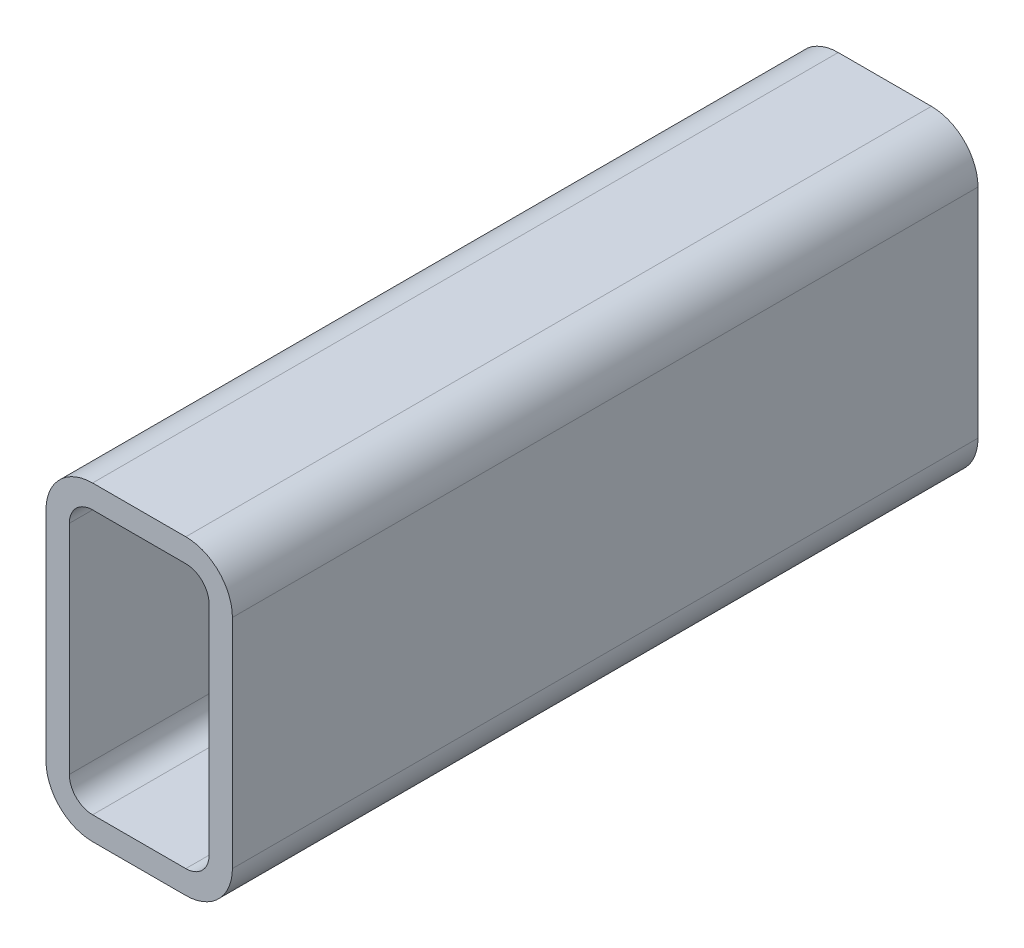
ISO-10303-21;
HEADER;
FILE_DESCRIPTION(('STEP AP214'),'2;1');
FILE_NAME('part.step','',(''),(''),'','','');
FILE_SCHEMA(('AUTOMOTIVE_DESIGN { 1 0 10303 214 1 1 1 1 }'));
ENDSEC;
DATA;
#1=APPLICATION_CONTEXT('core data for automotive mechanical design processes');
#2=APPLICATION_PROTOCOL_DEFINITION('international standard','automotive_design',2000,#1);
#3=PRODUCT_CONTEXT('',#1,'mechanical');
#4=PRODUCT('Part','Part','',(#3));
#5=PRODUCT_RELATED_PRODUCT_CATEGORY('part','',(#4));
#6=PRODUCT_DEFINITION_FORMATION('','',#4);
#7=PRODUCT_DEFINITION_CONTEXT('part definition',#1,'design');
#8=PRODUCT_DEFINITION('design','',#6,#7);
#9=PRODUCT_DEFINITION_SHAPE('','',#8);
#10=(LENGTH_UNIT() NAMED_UNIT(*) SI_UNIT(.MILLI.,.METRE.));
#11=(NAMED_UNIT(*) PLANE_ANGLE_UNIT() SI_UNIT($,.RADIAN.));
#12=(NAMED_UNIT(*) SI_UNIT($,.STERADIAN.) SOLID_ANGLE_UNIT());
#13=UNCERTAINTY_MEASURE_WITH_UNIT(LENGTH_MEASURE(1.E-05),#10,'distance_accuracy_value','');
#14=(GEOMETRIC_REPRESENTATION_CONTEXT(3) GLOBAL_UNCERTAINTY_ASSIGNED_CONTEXT((#13)) GLOBAL_UNIT_ASSIGNED_CONTEXT((#10,
#11,#12)) REPRESENTATION_CONTEXT('',''));
#15=CARTESIAN_POINT('',(0.,0.,0.));
#16=DIRECTION('',(0.,0.,1.));
#17=DIRECTION('',(1.,0.,0.));
#18=AXIS2_PLACEMENT_3D('',#15,#16,#17);
#19=CARTESIAN_POINT('',(21.5391160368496,109.98485662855,304.8));
#20=DIRECTION('',(0.,0.,1.));
#21=DIRECTION('',(1.,0.,0.));
#22=AXIS2_PLACEMENT_3D('',#19,#20,#21);
#23=PLANE('',#22);
#24=CARTESIAN_POINT('',(21.5391160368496,109.98485662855,304.8));
#25=DIRECTION('',(0.,0.,1.));
#26=DIRECTION('',(1.,0.,0.));
#27=AXIS2_PLACEMENT_3D('',#24,#25,#26);
#28=CIRCLE('',#27,19.05);
#29=CARTESIAN_POINT('',(21.5391160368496,129.03485662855,304.8));
#30=VERTEX_POINT('',#29);
#31=CARTESIAN_POINT('',(2.48911603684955,109.98485662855,304.8));
#32=VERTEX_POINT('',#31);
#33=EDGE_CURVE('E211',#30,#32,#28,.T.);
#34=ORIENTED_EDGE('',*,*,#33,.T.);
#35=DIRECTION('',(0.,-1.,0.));
#36=VECTOR('',#35,1.);
#37=CARTESIAN_POINT('',(2.48911603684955,21.08485662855,304.8));
#38=LINE('',#37,#36);
#39=CARTESIAN_POINT('',(2.48911603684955,21.08485662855,304.8));
#40=VERTEX_POINT('',#39);
#41=EDGE_CURVE('E214',#32,#40,#38,.T.);
#42=ORIENTED_EDGE('',*,*,#41,.T.);
#43=CARTESIAN_POINT('',(21.5391160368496,21.08485662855,304.8));
#44=DIRECTION('',(0.,0.,1.));
#45=DIRECTION('',(1.,0.,0.));
#46=AXIS2_PLACEMENT_3D('',#43,#44,#45);
#47=CIRCLE('',#46,19.05);
#48=CARTESIAN_POINT('',(21.5391160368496,2.03485662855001,304.8));
#49=VERTEX_POINT('',#48);
#50=EDGE_CURVE('E217',#40,#49,#47,.T.);
#51=ORIENTED_EDGE('',*,*,#50,.T.);
#52=DIRECTION('',(1.,0.,0.));
#53=VECTOR('',#52,1.);
#54=CARTESIAN_POINT('',(59.6391160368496,2.03485662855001,304.8));
#55=LINE('',#54,#53);
#56=CARTESIAN_POINT('',(59.6391160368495,2.03485662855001,304.8));
#57=VERTEX_POINT('',#56);
#58=EDGE_CURVE('E219',#49,#57,#55,.T.);
#59=ORIENTED_EDGE('',*,*,#58,.T.);
#60=CARTESIAN_POINT('',(59.6391160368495,21.08485662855,304.8));
#61=DIRECTION('',(0.,0.,1.));
#62=DIRECTION('',(1.,0.,0.));
#63=AXIS2_PLACEMENT_3D('',#60,#61,#62);
#64=CIRCLE('',#63,19.05);
#65=CARTESIAN_POINT('',(78.6891160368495,21.08485662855,304.8));
#66=VERTEX_POINT('',#65);
#67=EDGE_CURVE('E221',#57,#66,#64,.T.);
#68=ORIENTED_EDGE('',*,*,#67,.T.);
#69=DIRECTION('',(0.,1.,0.));
#70=VECTOR('',#69,1.);
#71=CARTESIAN_POINT('',(78.6891160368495,109.98485662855,304.8));
#72=LINE('',#71,#70);
#73=CARTESIAN_POINT('',(78.6891160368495,109.98485662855,304.8));
#74=VERTEX_POINT('',#73);
#75=EDGE_CURVE('E223',#66,#74,#72,.T.);
#76=ORIENTED_EDGE('',*,*,#75,.T.);
#77=CARTESIAN_POINT('',(59.6391160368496,109.98485662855,304.8));
#78=DIRECTION('',(0.,0.,1.));
#79=DIRECTION('',(1.,0.,0.));
#80=AXIS2_PLACEMENT_3D('',#77,#78,#79);
#81=CIRCLE('',#80,19.05);
#82=CARTESIAN_POINT('',(59.6391160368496,129.03485662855,304.8));
#83=VERTEX_POINT('',#82);
#84=EDGE_CURVE('E225',#74,#83,#81,.T.);
#85=ORIENTED_EDGE('',*,*,#84,.T.);
#86=DIRECTION('',(-1.,0.,0.));
#87=VECTOR('',#86,1.);
#88=CARTESIAN_POINT('',(21.5391160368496,129.03485662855,304.8));
#89=LINE('',#88,#87);
#90=EDGE_CURVE('E227',#83,#30,#89,.T.);
#91=ORIENTED_EDGE('',*,*,#90,.T.);
#92=EDGE_LOOP('',(#34,#42,#51,#59,#68,#76,#85,#91));
#93=FACE_BOUND('',#92,.T.);
#94=DIRECTION('',(0.,-1.,0.));
#95=VECTOR('',#94,1.);
#96=CARTESIAN_POINT('',(12.0141160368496,21.08485662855,304.8));
#97=LINE('',#96,#95);
#98=CARTESIAN_POINT('',(12.0141160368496,109.98485662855,304.8));
#99=VERTEX_POINT('',#98);
#100=CARTESIAN_POINT('',(12.0141160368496,21.08485662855,304.8));
#101=VERTEX_POINT('',#100);
#102=EDGE_CURVE('E154',#99,#101,#97,.T.);
#103=ORIENTED_EDGE('',*,*,#102,.F.);
#104=CARTESIAN_POINT('',(21.5391160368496,109.98485662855,304.8));
#105=DIRECTION('',(0.,0.,1.));
#106=DIRECTION('',(1.,0.,0.));
#107=AXIS2_PLACEMENT_3D('',#104,#105,#106);
#108=CIRCLE('',#107,9.525);
#109=CARTESIAN_POINT('',(21.5391160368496,119.50985662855,304.8));
#110=VERTEX_POINT('',#109);
#111=EDGE_CURVE('E146',#110,#99,#108,.T.);
#112=ORIENTED_EDGE('',*,*,#111,.F.);
#113=DIRECTION('',(-1.,0.,0.));
#114=VECTOR('',#113,1.);
#115=CARTESIAN_POINT('',(21.5391160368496,119.50985662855,304.8));
#116=LINE('',#115,#114);
#117=CARTESIAN_POINT('',(59.6391160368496,119.50985662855,304.8));
#118=VERTEX_POINT('',#117);
#119=EDGE_CURVE('E179',#118,#110,#116,.T.);
#120=ORIENTED_EDGE('',*,*,#119,.F.);
#121=CARTESIAN_POINT('',(59.6391160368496,109.98485662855,304.8));
#122=DIRECTION('',(0.,0.,1.));
#123=DIRECTION('',(1.,0.,0.));
#124=AXIS2_PLACEMENT_3D('',#121,#122,#123);
#125=CIRCLE('',#124,9.525);
#126=CARTESIAN_POINT('',(69.1641160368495,109.98485662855,304.8));
#127=VERTEX_POINT('',#126);
#128=EDGE_CURVE('E177',#127,#118,#125,.T.);
#129=ORIENTED_EDGE('',*,*,#128,.F.);
#130=DIRECTION('',(0.,1.,0.));
#131=VECTOR('',#130,1.);
#132=CARTESIAN_POINT('',(69.1641160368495,109.98485662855,304.8));
#133=LINE('',#132,#131);
#134=CARTESIAN_POINT('',(69.1641160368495,21.08485662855,304.8));
#135=VERTEX_POINT('',#134);
#136=EDGE_CURVE('E175',#135,#127,#133,.T.);
#137=ORIENTED_EDGE('',*,*,#136,.F.);
#138=CARTESIAN_POINT('',(59.6391160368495,21.08485662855,304.8));
#139=DIRECTION('',(0.,0.,1.));
#140=DIRECTION('',(1.,0.,0.));
#141=AXIS2_PLACEMENT_3D('',#138,#139,#140);
#142=CIRCLE('',#141,9.525);
#143=CARTESIAN_POINT('',(59.6391160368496,11.55985662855,304.8));
#144=VERTEX_POINT('',#143);
#145=EDGE_CURVE('E173',#144,#135,#142,.T.);
#146=ORIENTED_EDGE('',*,*,#145,.F.);
#147=DIRECTION('',(1.,0.,0.));
#148=VECTOR('',#147,1.);
#149=CARTESIAN_POINT('',(59.6391160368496,11.55985662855,304.8));
#150=LINE('',#149,#148);
#151=CARTESIAN_POINT('',(21.5391160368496,11.55985662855,304.8));
#152=VERTEX_POINT('',#151);
#153=EDGE_CURVE('E169',#152,#144,#150,.T.);
#154=ORIENTED_EDGE('',*,*,#153,.F.);
#155=CARTESIAN_POINT('',(21.5391160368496,21.08485662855,304.8));
#156=DIRECTION('',(0.,0.,1.));
#157=DIRECTION('',(1.,0.,0.));
#158=AXIS2_PLACEMENT_3D('',#155,#156,#157);
#159=CIRCLE('',#158,9.525);
#160=EDGE_CURVE('E167',#101,#152,#159,.T.);
#161=ORIENTED_EDGE('',*,*,#160,.F.);
#162=EDGE_LOOP('',(#103,#112,#120,#129,#137,#146,#154,#161));
#163=FACE_BOUND('',#162,.T.);
#164=ADVANCED_FACE('F33',(#93,#163),#23,.T.);
#165=CARTESIAN_POINT('',(21.5391160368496,109.98485662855,0.));
#166=DIRECTION('',(0.,0.,1.));
#167=DIRECTION('',(1.,0.,0.));
#168=AXIS2_PLACEMENT_3D('',#165,#166,#167);
#169=PLANE('',#168);
#170=CARTESIAN_POINT('',(21.5391160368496,109.98485662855,0.));
#171=DIRECTION('',(0.,0.,1.));
#172=DIRECTION('',(1.,0.,0.));
#173=AXIS2_PLACEMENT_3D('',#170,#171,#172);
#174=CIRCLE('',#173,19.05);
#175=CARTESIAN_POINT('',(21.5391160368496,129.03485662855,0.));
#176=VERTEX_POINT('',#175);
#177=CARTESIAN_POINT('',(2.48911603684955,109.98485662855,0.));
#178=VERTEX_POINT('',#177);
#179=EDGE_CURVE('E162',#176,#178,#174,.T.);
#180=ORIENTED_EDGE('',*,*,#179,.F.);
#181=DIRECTION('',(-1.,0.,0.));
#182=VECTOR('',#181,1.);
#183=CARTESIAN_POINT('',(21.5391160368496,129.03485662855,0.));
#184=LINE('',#183,#182);
#185=CARTESIAN_POINT('',(59.6391160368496,129.03485662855,0.));
#186=VERTEX_POINT('',#185);
#187=EDGE_CURVE('E215',#186,#176,#184,.T.);
#188=ORIENTED_EDGE('',*,*,#187,.F.);
#189=CARTESIAN_POINT('',(59.6391160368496,109.98485662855,0.));
#190=DIRECTION('',(0.,0.,1.));
#191=DIRECTION('',(1.,0.,0.));
#192=AXIS2_PLACEMENT_3D('',#189,#190,#191);
#193=CIRCLE('',#192,19.05);
#194=CARTESIAN_POINT('',(78.6891160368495,109.98485662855,0.));
#195=VERTEX_POINT('',#194);
#196=EDGE_CURVE('E242',#195,#186,#193,.T.);
#197=ORIENTED_EDGE('',*,*,#196,.F.);
#198=DIRECTION('',(0.,1.,0.));
#199=VECTOR('',#198,1.);
#200=CARTESIAN_POINT('',(78.6891160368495,109.98485662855,0.));
#201=LINE('',#200,#199);
#202=CARTESIAN_POINT('',(78.6891160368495,21.08485662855,0.));
#203=VERTEX_POINT('',#202);
#204=EDGE_CURVE('E240',#203,#195,#201,.T.);
#205=ORIENTED_EDGE('',*,*,#204,.F.);
#206=CARTESIAN_POINT('',(59.6391160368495,21.08485662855,0.));
#207=DIRECTION('',(0.,0.,1.));
#208=DIRECTION('',(1.,0.,0.));
#209=AXIS2_PLACEMENT_3D('',#206,#207,#208);
#210=CIRCLE('',#209,19.05);
#211=CARTESIAN_POINT('',(59.6391160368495,2.03485662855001,0.));
#212=VERTEX_POINT('',#211);
#213=EDGE_CURVE('E238',#212,#203,#210,.T.);
#214=ORIENTED_EDGE('',*,*,#213,.F.);
#215=DIRECTION('',(1.,0.,0.));
#216=VECTOR('',#215,1.);
#217=CARTESIAN_POINT('',(59.6391160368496,2.03485662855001,0.));
#218=LINE('',#217,#216);
#219=CARTESIAN_POINT('',(21.5391160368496,2.03485662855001,0.));
#220=VERTEX_POINT('',#219);
#221=EDGE_CURVE('E236',#220,#212,#218,.T.);
#222=ORIENTED_EDGE('',*,*,#221,.F.);
#223=CARTESIAN_POINT('',(21.5391160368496,21.08485662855,0.));
#224=DIRECTION('',(0.,0.,1.));
#225=DIRECTION('',(1.,0.,0.));
#226=AXIS2_PLACEMENT_3D('',#223,#224,#225);
#227=CIRCLE('',#226,19.05);
#228=CARTESIAN_POINT('',(2.48911603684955,21.08485662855,0.));
#229=VERTEX_POINT('',#228);
#230=EDGE_CURVE('E234',#229,#220,#227,.T.);
#231=ORIENTED_EDGE('',*,*,#230,.F.);
#232=DIRECTION('',(0.,-1.,0.));
#233=VECTOR('',#232,1.);
#234=CARTESIAN_POINT('',(2.48911603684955,21.08485662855,0.));
#235=LINE('',#234,#233);
#236=EDGE_CURVE('E232',#178,#229,#235,.T.);
#237=ORIENTED_EDGE('',*,*,#236,.F.);
#238=EDGE_LOOP('',(#180,#188,#197,#205,#214,#222,#231,#237));
#239=FACE_BOUND('',#238,.T.);
#240=CARTESIAN_POINT('',(21.5391160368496,109.98485662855,0.));
#241=DIRECTION('',(0.,0.,1.));
#242=DIRECTION('',(1.,0.,0.));
#243=AXIS2_PLACEMENT_3D('',#240,#241,#242);
#244=CIRCLE('',#243,9.525);
#245=CARTESIAN_POINT('',(21.5391160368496,119.50985662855,0.));
#246=VERTEX_POINT('',#245);
#247=CARTESIAN_POINT('',(12.0141160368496,109.98485662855,0.));
#248=VERTEX_POINT('',#247);
#249=EDGE_CURVE('E56',#246,#248,#244,.T.);
#250=ORIENTED_EDGE('',*,*,#249,.T.);
#251=DIRECTION('',(0.,-1.,0.));
#252=VECTOR('',#251,1.);
#253=CARTESIAN_POINT('',(12.0141160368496,21.08485662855,0.));
#254=LINE('',#253,#252);
#255=CARTESIAN_POINT('',(12.0141160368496,21.08485662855,0.));
#256=VERTEX_POINT('',#255);
#257=EDGE_CURVE('E161',#248,#256,#254,.T.);
#258=ORIENTED_EDGE('',*,*,#257,.T.);
#259=CARTESIAN_POINT('',(21.5391160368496,21.08485662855,0.));
#260=DIRECTION('',(0.,0.,1.));
#261=DIRECTION('',(1.,0.,0.));
#262=AXIS2_PLACEMENT_3D('',#259,#260,#261);
#263=CIRCLE('',#262,9.525);
#264=CARTESIAN_POINT('',(21.5391160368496,11.55985662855,0.));
#265=VERTEX_POINT('',#264);
#266=EDGE_CURVE('E183',#256,#265,#263,.T.);
#267=ORIENTED_EDGE('',*,*,#266,.T.);
#268=DIRECTION('',(1.,0.,0.));
#269=VECTOR('',#268,1.);
#270=CARTESIAN_POINT('',(59.6391160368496,11.55985662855,0.));
#271=LINE('',#270,#269);
#272=CARTESIAN_POINT('',(59.6391160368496,11.55985662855,0.));
#273=VERTEX_POINT('',#272);
#274=EDGE_CURVE('E186',#265,#273,#271,.T.);
#275=ORIENTED_EDGE('',*,*,#274,.T.);
#276=CARTESIAN_POINT('',(59.6391160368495,21.08485662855,0.));
#277=DIRECTION('',(0.,0.,1.));
#278=DIRECTION('',(1.,0.,0.));
#279=AXIS2_PLACEMENT_3D('',#276,#277,#278);
#280=CIRCLE('',#279,9.525);
#281=CARTESIAN_POINT('',(69.1641160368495,21.08485662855,0.));
#282=VERTEX_POINT('',#281);
#283=EDGE_CURVE('E189',#273,#282,#280,.T.);
#284=ORIENTED_EDGE('',*,*,#283,.T.);
#285=DIRECTION('',(0.,1.,0.));
#286=VECTOR('',#285,1.);
#287=CARTESIAN_POINT('',(69.1641160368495,109.98485662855,0.));
#288=LINE('',#287,#286);
#289=CARTESIAN_POINT('',(69.1641160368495,109.98485662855,0.));
#290=VERTEX_POINT('',#289);
#291=EDGE_CURVE('E192',#282,#290,#288,.T.);
#292=ORIENTED_EDGE('',*,*,#291,.T.);
#293=CARTESIAN_POINT('',(59.6391160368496,109.98485662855,0.));
#294=DIRECTION('',(0.,0.,1.));
#295=DIRECTION('',(1.,0.,0.));
#296=AXIS2_PLACEMENT_3D('',#293,#294,#295);
#297=CIRCLE('',#296,9.525);
#298=CARTESIAN_POINT('',(59.6391160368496,119.50985662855,0.));
#299=VERTEX_POINT('',#298);
#300=EDGE_CURVE('E195',#290,#299,#297,.T.);
#301=ORIENTED_EDGE('',*,*,#300,.T.);
#302=DIRECTION('',(-1.,0.,0.));
#303=VECTOR('',#302,1.);
#304=CARTESIAN_POINT('',(21.5391160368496,119.50985662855,0.));
#305=LINE('',#304,#303);
#306=EDGE_CURVE('E155',#299,#246,#305,.T.);
#307=ORIENTED_EDGE('',*,*,#306,.T.);
#308=EDGE_LOOP('',(#250,#258,#267,#275,#284,#292,#301,#307));
#309=FACE_BOUND('',#308,.T.);
#310=ADVANCED_FACE('F272',(#239,#309),#169,.F.);
#311=CARTESIAN_POINT('',(21.5391160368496,109.98485662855,304.8));
#312=DIRECTION('',(0.,0.,-1.));
#313=DIRECTION('',(-1.,0.,0.));
#314=AXIS2_PLACEMENT_3D('',#311,#312,#313);
#315=CYLINDRICAL_SURFACE('',#314,19.05);
#316=ORIENTED_EDGE('',*,*,#179,.T.);
#317=DIRECTION('',(0.,0.,-1.));
#318=VECTOR('',#317,1.);
#319=CARTESIAN_POINT('',(2.48911603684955,109.98485662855,304.8));
#320=LINE('',#319,#318);
#321=EDGE_CURVE('E11',#32,#178,#320,.T.);
#322=ORIENTED_EDGE('',*,*,#321,.F.);
#323=ORIENTED_EDGE('',*,*,#33,.F.);
#324=DIRECTION('',(0.,0.,-1.));
#325=VECTOR('',#324,1.);
#326=CARTESIAN_POINT('',(21.5391160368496,129.03485662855,304.8));
#327=LINE('',#326,#325);
#328=EDGE_CURVE('E229',#30,#176,#327,.T.);
#329=ORIENTED_EDGE('',*,*,#328,.T.);
#330=EDGE_LOOP('',(#316,#322,#323,#329));
#331=FACE_BOUND('',#330,.T.);
#332=ADVANCED_FACE('F35',(#331),#315,.T.);
#333=CARTESIAN_POINT('',(2.48911603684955,21.08485662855,304.8));
#334=DIRECTION('',(1.,0.,0.));
#335=DIRECTION('',(0.,0.,-1.));
#336=AXIS2_PLACEMENT_3D('',#333,#334,#335);
#337=PLANE('',#336);
#338=ORIENTED_EDGE('',*,*,#236,.T.);
#339=DIRECTION('',(0.,0.,-1.));
#340=VECTOR('',#339,1.);
#341=CARTESIAN_POINT('',(2.48911603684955,21.08485662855,304.8));
#342=LINE('',#341,#340);
#343=EDGE_CURVE('E41',#40,#229,#342,.T.);
#344=ORIENTED_EDGE('',*,*,#343,.F.);
#345=ORIENTED_EDGE('',*,*,#41,.F.);
#346=ORIENTED_EDGE('',*,*,#321,.T.);
#347=EDGE_LOOP('',(#338,#344,#345,#346));
#348=FACE_BOUND('',#347,.T.);
#349=ADVANCED_FACE('F289',(#348),#337,.F.);
#350=CARTESIAN_POINT('',(21.5391160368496,21.08485662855,304.8));
#351=DIRECTION('',(0.,0.,-1.));
#352=DIRECTION('',(-1.,0.,0.));
#353=AXIS2_PLACEMENT_3D('',#350,#351,#352);
#354=CYLINDRICAL_SURFACE('',#353,19.05);
#355=ORIENTED_EDGE('',*,*,#230,.T.);
#356=DIRECTION('',(0.,0.,-1.));
#357=VECTOR('',#356,1.);
#358=CARTESIAN_POINT('',(21.5391160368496,2.03485662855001,304.8));
#359=LINE('',#358,#357);
#360=EDGE_CURVE('E259',#49,#220,#359,.T.);
#361=ORIENTED_EDGE('',*,*,#360,.F.);
#362=ORIENTED_EDGE('',*,*,#50,.F.);
#363=ORIENTED_EDGE('',*,*,#343,.T.);
#364=EDGE_LOOP('',(#355,#361,#362,#363));
#365=FACE_BOUND('',#364,.T.);
#366=ADVANCED_FACE('F266',(#365),#354,.T.);
#367=CARTESIAN_POINT('',(59.6391160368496,2.03485662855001,304.8));
#368=DIRECTION('',(0.,1.,0.));
#369=DIRECTION('',(0.,0.,1.));
#370=AXIS2_PLACEMENT_3D('',#367,#368,#369);
#371=PLANE('',#370);
#372=ORIENTED_EDGE('',*,*,#221,.T.);
#373=DIRECTION('',(0.,0.,-1.));
#374=VECTOR('',#373,1.);
#375=CARTESIAN_POINT('',(59.6391160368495,2.03485662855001,304.8));
#376=LINE('',#375,#374);
#377=EDGE_CURVE('E256',#57,#212,#376,.T.);
#378=ORIENTED_EDGE('',*,*,#377,.F.);
#379=ORIENTED_EDGE('',*,*,#58,.F.);
#380=ORIENTED_EDGE('',*,*,#360,.T.);
#381=EDGE_LOOP('',(#372,#378,#379,#380));
#382=FACE_BOUND('',#381,.T.);
#383=ADVANCED_FACE('F278',(#382),#371,.F.);
#384=CARTESIAN_POINT('',(59.6391160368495,21.08485662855,304.8));
#385=DIRECTION('',(0.,0.,-1.));
#386=DIRECTION('',(-1.,0.,0.));
#387=AXIS2_PLACEMENT_3D('',#384,#385,#386);
#388=CYLINDRICAL_SURFACE('',#387,19.05);
#389=ORIENTED_EDGE('',*,*,#213,.T.);
#390=DIRECTION('',(0.,0.,-1.));
#391=VECTOR('',#390,1.);
#392=CARTESIAN_POINT('',(78.6891160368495,21.08485662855,304.8));
#393=LINE('',#392,#391);
#394=EDGE_CURVE('E253',#66,#203,#393,.T.);
#395=ORIENTED_EDGE('',*,*,#394,.F.);
#396=ORIENTED_EDGE('',*,*,#67,.F.);
#397=ORIENTED_EDGE('',*,*,#377,.T.);
#398=EDGE_LOOP('',(#389,#395,#396,#397));
#399=FACE_BOUND('',#398,.T.);
#400=ADVANCED_FACE('F282',(#399),#388,.T.);
#401=CARTESIAN_POINT('',(78.6891160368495,109.98485662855,304.8));
#402=DIRECTION('',(-1.,0.,0.));
#403=DIRECTION('',(0.,0.,1.));
#404=AXIS2_PLACEMENT_3D('',#401,#402,#403);
#405=PLANE('',#404);
#406=ORIENTED_EDGE('',*,*,#204,.T.);
#407=DIRECTION('',(0.,0.,-1.));
#408=VECTOR('',#407,1.);
#409=CARTESIAN_POINT('',(78.6891160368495,109.98485662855,304.8));
#410=LINE('',#409,#408);
#411=EDGE_CURVE('E250',#74,#195,#410,.T.);
#412=ORIENTED_EDGE('',*,*,#411,.F.);
#413=ORIENTED_EDGE('',*,*,#75,.F.);
#414=ORIENTED_EDGE('',*,*,#394,.T.);
#415=EDGE_LOOP('',(#406,#412,#413,#414));
#416=FACE_BOUND('',#415,.T.);
#417=ADVANCED_FACE('F302',(#416),#405,.F.);
#418=CARTESIAN_POINT('',(59.6391160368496,109.98485662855,304.8));
#419=DIRECTION('',(0.,0.,-1.));
#420=DIRECTION('',(-1.,0.,0.));
#421=AXIS2_PLACEMENT_3D('',#418,#419,#420);
#422=CYLINDRICAL_SURFACE('',#421,19.05);
#423=ORIENTED_EDGE('',*,*,#196,.T.);
#424=DIRECTION('',(0.,0.,-1.));
#425=VECTOR('',#424,1.);
#426=CARTESIAN_POINT('',(59.6391160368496,129.03485662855,304.8));
#427=LINE('',#426,#425);
#428=EDGE_CURVE('E247',#83,#186,#427,.T.);
#429=ORIENTED_EDGE('',*,*,#428,.F.);
#430=ORIENTED_EDGE('',*,*,#84,.F.);
#431=ORIENTED_EDGE('',*,*,#411,.T.);
#432=EDGE_LOOP('',(#423,#429,#430,#431));
#433=FACE_BOUND('',#432,.T.);
#434=ADVANCED_FACE('F300',(#433),#422,.T.);
#435=CARTESIAN_POINT('',(21.5391160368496,129.03485662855,304.8));
#436=DIRECTION('',(0.,-1.,0.));
#437=DIRECTION('',(0.,0.,-1.));
#438=AXIS2_PLACEMENT_3D('',#435,#436,#437);
#439=PLANE('',#438);
#440=ORIENTED_EDGE('',*,*,#187,.T.);
#441=ORIENTED_EDGE('',*,*,#328,.F.);
#442=ORIENTED_EDGE('',*,*,#90,.F.);
#443=ORIENTED_EDGE('',*,*,#428,.T.);
#444=EDGE_LOOP('',(#440,#441,#442,#443));
#445=FACE_BOUND('',#444,.T.);
#446=ADVANCED_FACE('F295',(#445),#439,.F.);
#447=CARTESIAN_POINT('',(21.5391160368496,109.98485662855,304.8));
#448=DIRECTION('',(0.,0.,-1.));
#449=DIRECTION('',(-1.,0.,0.));
#450=AXIS2_PLACEMENT_3D('',#447,#448,#449);
#451=CYLINDRICAL_SURFACE('',#450,9.525);
#452=ORIENTED_EDGE('',*,*,#249,.F.);
#453=DIRECTION('',(0.,0.,-1.));
#454=VECTOR('',#453,1.);
#455=CARTESIAN_POINT('',(21.5391160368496,119.50985662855,304.8));
#456=LINE('',#455,#454);
#457=EDGE_CURVE('E150',#110,#246,#456,.T.);
#458=ORIENTED_EDGE('',*,*,#457,.F.);
#459=ORIENTED_EDGE('',*,*,#111,.T.);
#460=DIRECTION('',(0.,0.,-1.));
#461=VECTOR('',#460,1.);
#462=CARTESIAN_POINT('',(12.0141160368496,109.98485662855,304.8));
#463=LINE('',#462,#461);
#464=EDGE_CURVE('E149',#99,#248,#463,.T.);
#465=ORIENTED_EDGE('',*,*,#464,.T.);
#466=EDGE_LOOP('',(#452,#458,#459,#465));
#467=FACE_BOUND('',#466,.T.);
#468=ADVANCED_FACE('F148',(#467),#451,.F.);
#469=CARTESIAN_POINT('',(12.0141160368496,21.08485662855,304.8));
#470=DIRECTION('',(1.,0.,0.));
#471=DIRECTION('',(0.,0.,-1.));
#472=AXIS2_PLACEMENT_3D('',#469,#470,#471);
#473=PLANE('',#472);
#474=ORIENTED_EDGE('',*,*,#257,.F.);
#475=ORIENTED_EDGE('',*,*,#464,.F.);
#476=ORIENTED_EDGE('',*,*,#102,.T.);
#477=DIRECTION('',(0.,0.,-1.));
#478=VECTOR('',#477,1.);
#479=CARTESIAN_POINT('',(12.0141160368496,21.08485662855,304.8));
#480=LINE('',#479,#478);
#481=EDGE_CURVE('E163',#101,#256,#480,.T.);
#482=ORIENTED_EDGE('',*,*,#481,.T.);
#483=EDGE_LOOP('',(#474,#475,#476,#482));
#484=FACE_BOUND('',#483,.T.);
#485=ADVANCED_FACE('F158',(#484),#473,.T.);
#486=CARTESIAN_POINT('',(21.5391160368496,21.08485662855,304.8));
#487=DIRECTION('',(0.,0.,-1.));
#488=DIRECTION('',(-1.,0.,0.));
#489=AXIS2_PLACEMENT_3D('',#486,#487,#488);
#490=CYLINDRICAL_SURFACE('',#489,9.525);
#491=ORIENTED_EDGE('',*,*,#266,.F.);
#492=ORIENTED_EDGE('',*,*,#481,.F.);
#493=ORIENTED_EDGE('',*,*,#160,.T.);
#494=DIRECTION('',(0.,0.,-1.));
#495=VECTOR('',#494,1.);
#496=CARTESIAN_POINT('',(21.5391160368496,11.55985662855,304.8));
#497=LINE('',#496,#495);
#498=EDGE_CURVE('E208',#152,#265,#497,.T.);
#499=ORIENTED_EDGE('',*,*,#498,.T.);
#500=EDGE_LOOP('',(#491,#492,#493,#499));
#501=FACE_BOUND('',#500,.T.);
#502=ADVANCED_FACE('F327',(#501),#490,.F.);
#503=CARTESIAN_POINT('',(59.6391160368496,11.55985662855,304.8));
#504=DIRECTION('',(0.,1.,0.));
#505=DIRECTION('',(0.,0.,1.));
#506=AXIS2_PLACEMENT_3D('',#503,#504,#505);
#507=PLANE('',#506);
#508=ORIENTED_EDGE('',*,*,#274,.F.);
#509=ORIENTED_EDGE('',*,*,#498,.F.);
#510=ORIENTED_EDGE('',*,*,#153,.T.);
#511=DIRECTION('',(0.,0.,-1.));
#512=VECTOR('',#511,1.);
#513=CARTESIAN_POINT('',(59.6391160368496,11.55985662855,304.8));
#514=LINE('',#513,#512);
#515=EDGE_CURVE('E206',#144,#273,#514,.T.);
#516=ORIENTED_EDGE('',*,*,#515,.T.);
#517=EDGE_LOOP('',(#508,#509,#510,#516));
#518=FACE_BOUND('',#517,.T.);
#519=ADVANCED_FACE('F331',(#518),#507,.T.);
#520=CARTESIAN_POINT('',(59.6391160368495,21.08485662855,304.8));
#521=DIRECTION('',(0.,0.,-1.));
#522=DIRECTION('',(-1.,0.,0.));
#523=AXIS2_PLACEMENT_3D('',#520,#521,#522);
#524=CYLINDRICAL_SURFACE('',#523,9.525);
#525=ORIENTED_EDGE('',*,*,#283,.F.);
#526=ORIENTED_EDGE('',*,*,#515,.F.);
#527=ORIENTED_EDGE('',*,*,#145,.T.);
#528=DIRECTION('',(0.,0.,-1.));
#529=VECTOR('',#528,1.);
#530=CARTESIAN_POINT('',(69.1641160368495,21.08485662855,304.8));
#531=LINE('',#530,#529);
#532=EDGE_CURVE('E204',#135,#282,#531,.T.);
#533=ORIENTED_EDGE('',*,*,#532,.T.);
#534=EDGE_LOOP('',(#525,#526,#527,#533));
#535=FACE_BOUND('',#534,.T.);
#536=ADVANCED_FACE('F337',(#535),#524,.F.);
#537=CARTESIAN_POINT('',(69.1641160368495,109.98485662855,304.8));
#538=DIRECTION('',(-1.,0.,0.));
#539=DIRECTION('',(0.,0.,1.));
#540=AXIS2_PLACEMENT_3D('',#537,#538,#539);
#541=PLANE('',#540);
#542=ORIENTED_EDGE('',*,*,#291,.F.);
#543=ORIENTED_EDGE('',*,*,#532,.F.);
#544=ORIENTED_EDGE('',*,*,#136,.T.);
#545=DIRECTION('',(0.,0.,-1.));
#546=VECTOR('',#545,1.);
#547=CARTESIAN_POINT('',(69.1641160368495,109.98485662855,304.8));
#548=LINE('',#547,#546);
#549=EDGE_CURVE('E202',#127,#290,#548,.T.);
#550=ORIENTED_EDGE('',*,*,#549,.T.);
#551=EDGE_LOOP('',(#542,#543,#544,#550));
#552=FACE_BOUND('',#551,.T.);
#553=ADVANCED_FACE('F341',(#552),#541,.T.);
#554=CARTESIAN_POINT('',(59.6391160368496,109.98485662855,304.8));
#555=DIRECTION('',(0.,0.,-1.));
#556=DIRECTION('',(-1.,0.,0.));
#557=AXIS2_PLACEMENT_3D('',#554,#555,#556);
#558=CYLINDRICAL_SURFACE('',#557,9.525);
#559=ORIENTED_EDGE('',*,*,#300,.F.);
#560=ORIENTED_EDGE('',*,*,#549,.F.);
#561=ORIENTED_EDGE('',*,*,#128,.T.);
#562=DIRECTION('',(0.,0.,-1.));
#563=VECTOR('',#562,1.);
#564=CARTESIAN_POINT('',(59.6391160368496,119.50985662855,304.8));
#565=LINE('',#564,#563);
#566=EDGE_CURVE('E48',#118,#299,#565,.T.);
#567=ORIENTED_EDGE('',*,*,#566,.T.);
#568=EDGE_LOOP('',(#559,#560,#561,#567));
#569=FACE_BOUND('',#568,.T.);
#570=ADVANCED_FACE('F345',(#569),#558,.F.);
#571=CARTESIAN_POINT('',(21.5391160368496,119.50985662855,304.8));
#572=DIRECTION('',(0.,-1.,0.));
#573=DIRECTION('',(0.,0.,-1.));
#574=AXIS2_PLACEMENT_3D('',#571,#572,#573);
#575=PLANE('',#574);
#576=ORIENTED_EDGE('',*,*,#306,.F.);
#577=ORIENTED_EDGE('',*,*,#566,.F.);
#578=ORIENTED_EDGE('',*,*,#119,.T.);
#579=ORIENTED_EDGE('',*,*,#457,.T.);
#580=EDGE_LOOP('',(#576,#577,#578,#579));
#581=FACE_BOUND('',#580,.T.);
#582=ADVANCED_FACE('F349',(#581),#575,.T.);
#583=CLOSED_SHELL('',(#164,#310,#332,#349,#366,#383,#400,#417,#434,#446,#468,#485,#502,#519,
#536,#553,#570,#582));
#584=MANIFOLD_SOLID_BREP('B2',#583);
#585=ADVANCED_BREP_SHAPE_REPRESENTATION('',(#18,#584),#14);
#586=SHAPE_DEFINITION_REPRESENTATION(#9,#585);
ENDSEC;
END-ISO-10303-21;
